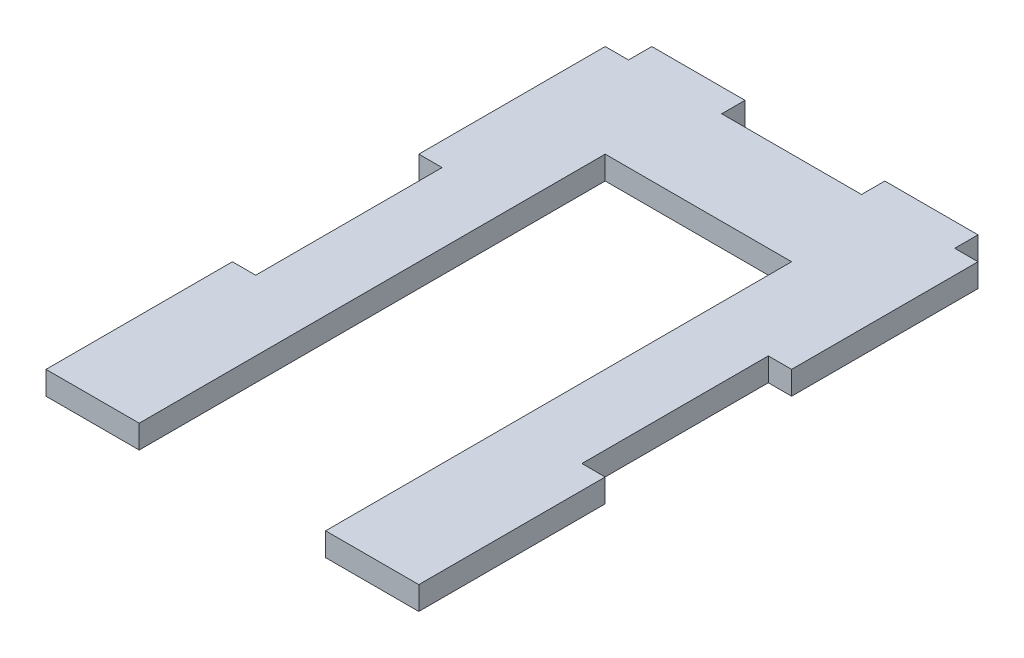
from build123d import *

# Parameters (mm, degrees)
BOSS_EXTRUDE1_DEPTH = 3.175


with BuildPart() as part:
    # Sketch1 → Boss-Extrude1 (new body)
    with BuildSketch(Plane(origin=(0, 0, 0), x_dir=(1, 0, 0), z_dir=(0, 1, 0))):
        Polygon((-25.4, -3.175), (-25.4, -28.575), (-22.225, -28.575), (-22.225, -53.975), (-25.4, -53.975), (-25.4, -79.375), (-22.225, -79.375), (-12.7, -79.375), (-12.7, -15.875), (12.7, -15.875), (12.7, -79.375), (22.225, -79.375), (25.4, -79.375), (25.4, -53.975), (22.225, -53.975), (22.225, -28.575), (25.4, -28.575), (25.4, -3.175), (22.225, -3.175), (22.225, 0), (9.525, 0), (9.525, -3.175), (-9.525, -3.175), (-9.525, 0), (-22.225, 0), (-22.225, -3.175), align=None)
    extrude(amount=BOSS_EXTRUDE1_DEPTH)


solid = part.part
